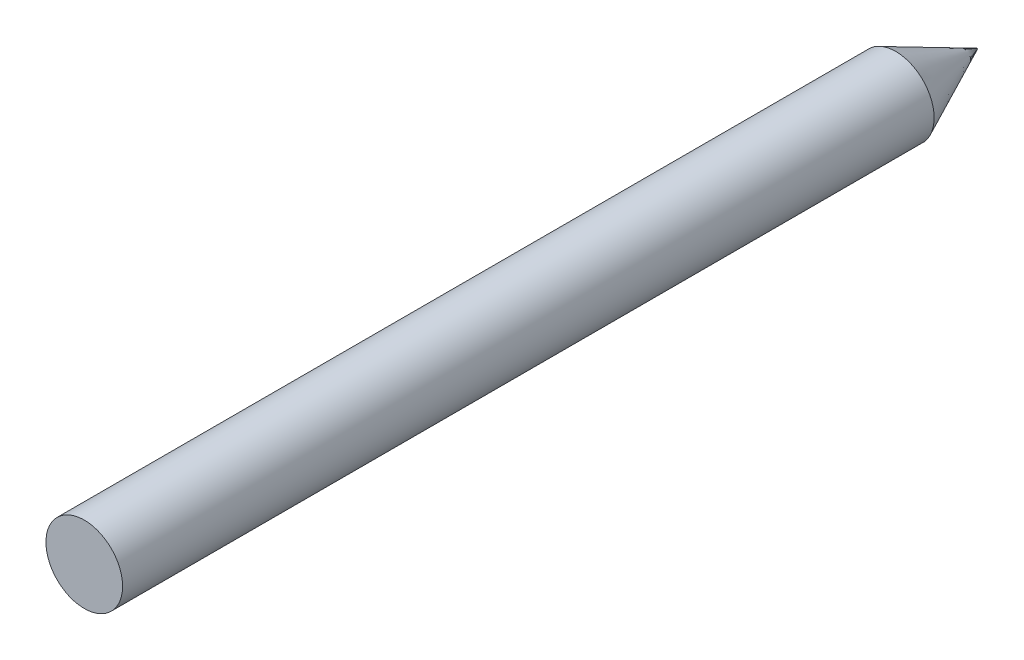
from build123d import *

# Parameters (mm, degrees)
EXTRUSION1_DEPTH      = 40
EXTRUSION1_DEPTH_BACK = 50
ESQUISSE1_R           = 4.25


with BuildPart() as part:
    # Esquisse1 → Extrusion1 (new, two sides: drawn at the far end of the back side and taken through both)
    with BuildSketch(Plane.XY.offset(-EXTRUSION1_DEPTH_BACK)):
        Circle(ESQUISSE1_R)
    extrude(amount=EXTRUSION1_DEPTH + EXTRUSION1_DEPTH_BACK)

    # Extrusion2 cone 1 section (on through the dimple's axis) → Extrusion2 (revolve)
    with BuildSketch(Plane(origin=(0, 0, -50), x_dir=(0, -1, 0), z_dir=(1, 0, 0))):
        Polygon((0, 0), (4.25, 0), (0, 9.114154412), align=None)
    revolve(axis=Axis((0, 0, -50), (0, 0, -1)))


solid = part.part
